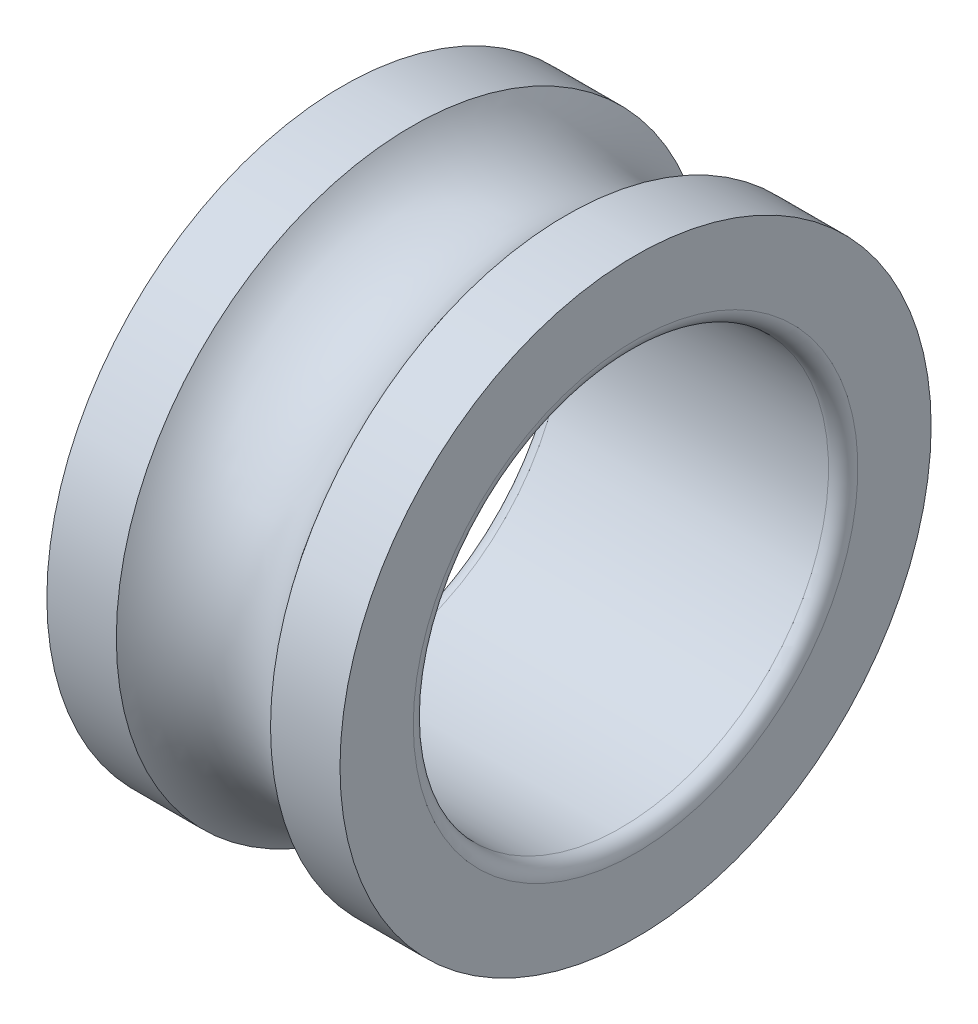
ISO-10303-21;
HEADER;
FILE_DESCRIPTION(('STEP AP214'),'2;1');
FILE_NAME('part.step','',(''),(''),'','','');
FILE_SCHEMA(('AUTOMOTIVE_DESIGN { 1 0 10303 214 1 1 1 1 }'));
ENDSEC;
DATA;
#1=APPLICATION_CONTEXT('core data for automotive mechanical design processes');
#2=APPLICATION_PROTOCOL_DEFINITION('international standard','automotive_design',2000,#1);
#3=PRODUCT_CONTEXT('',#1,'mechanical');
#4=PRODUCT('Part','Part','',(#3));
#5=PRODUCT_RELATED_PRODUCT_CATEGORY('part','',(#4));
#6=PRODUCT_DEFINITION_FORMATION('','',#4);
#7=PRODUCT_DEFINITION_CONTEXT('part definition',#1,'design');
#8=PRODUCT_DEFINITION('design','',#6,#7);
#9=PRODUCT_DEFINITION_SHAPE('','',#8);
#10=(LENGTH_UNIT() NAMED_UNIT(*) SI_UNIT(.MILLI.,.METRE.));
#11=(NAMED_UNIT(*) PLANE_ANGLE_UNIT() SI_UNIT($,.RADIAN.));
#12=(NAMED_UNIT(*) SI_UNIT($,.STERADIAN.) SOLID_ANGLE_UNIT());
#13=UNCERTAINTY_MEASURE_WITH_UNIT(LENGTH_MEASURE(1.E-05),#10,'distance_accuracy_value','');
#14=(GEOMETRIC_REPRESENTATION_CONTEXT(3) GLOBAL_UNCERTAINTY_ASSIGNED_CONTEXT((#13)) GLOBAL_UNIT_ASSIGNED_CONTEXT((#10,
#11,#12)) REPRESENTATION_CONTEXT('',''));
#15=CARTESIAN_POINT('',(0.,0.,0.));
#16=DIRECTION('',(0.,0.,1.));
#17=DIRECTION('',(1.,0.,0.));
#18=AXIS2_PLACEMENT_3D('',#15,#16,#17);
#19=CARTESIAN_POINT('',(0.,0.,0.));
#20=DIRECTION('',(-1.,0.,0.));
#21=DIRECTION('',(0.,0.,1.));
#22=AXIS2_PLACEMENT_3D('',#19,#20,#21);
#23=CYLINDRICAL_SURFACE('',#22,12.1);
#24=CARTESIAN_POINT('',(0.,0.,0.));
#25=DIRECTION('',(-1.,0.,0.));
#26=DIRECTION('',(0.,0.,1.));
#27=AXIS2_PLACEMENT_3D('',#24,#25,#26);
#28=CIRCLE('',#27,12.1);
#29=CARTESIAN_POINT('',(0.,0.,12.1));
#30=VERTEX_POINT('',#29);
#31=EDGE_CURVE('E10',#30,#30,#28,.T.);
#32=ORIENTED_EDGE('',*,*,#31,.F.);
#33=EDGE_LOOP('',(#32));
#34=FACE_BOUND('',#33,.T.);
#35=CARTESIAN_POINT('',(2.84344817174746,0.,0.));
#36=DIRECTION('',(-1.,0.,0.));
#37=DIRECTION('',(0.,0.,1.));
#38=AXIS2_PLACEMENT_3D('',#35,#36,#37);
#39=CIRCLE('',#38,12.1);
#40=CARTESIAN_POINT('',(2.84344817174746,0.,12.1));
#41=VERTEX_POINT('',#40);
#42=EDGE_CURVE('E42',#41,#41,#39,.T.);
#43=ORIENTED_EDGE('',*,*,#42,.T.);
#44=EDGE_LOOP('',(#43));
#45=FACE_BOUND('',#44,.T.);
#46=ADVANCED_FACE('F14',(#34,#45),#23,.T.);
#47=CARTESIAN_POINT('',(0.,12.1,0.));
#48=DIRECTION('',(1.,0.,0.));
#49=DIRECTION('',(0.,0.,-1.));
#50=AXIS2_PLACEMENT_3D('',#47,#48,#49);
#51=PLANE('',#50);
#52=CARTESIAN_POINT('',(0.,0.,0.));
#53=DIRECTION('',(-1.,0.,0.));
#54=DIRECTION('',(0.,0.,1.));
#55=AXIS2_PLACEMENT_3D('',#52,#53,#54);
#56=CIRCLE('',#55,9.1);
#57=CARTESIAN_POINT('',(0.,0.,9.1));
#58=VERTEX_POINT('',#57);
#59=EDGE_CURVE('E20',#58,#58,#56,.T.);
#60=ORIENTED_EDGE('',*,*,#59,.F.);
#61=EDGE_LOOP('',(#60));
#62=FACE_BOUND('',#61,.T.);
#63=ORIENTED_EDGE('',*,*,#31,.T.);
#64=EDGE_LOOP('',(#63));
#65=FACE_BOUND('',#64,.T.);
#66=ADVANCED_FACE('F60',(#62,#65),#51,.F.);
#67=CARTESIAN_POINT('',(0.6,0.,0.));
#68=DIRECTION('',(-1.,0.,0.));
#69=DIRECTION('',(0.,0.,1.));
#70=AXIS2_PLACEMENT_3D('',#67,#68,#69);
#71=TOROIDAL_SURFACE('',#70,9.1,0.6);
#72=CARTESIAN_POINT('',(0.6,0.,0.));
#73=DIRECTION('',(-1.,0.,0.));
#74=DIRECTION('',(0.,0.,1.));
#75=AXIS2_PLACEMENT_3D('',#72,#73,#74);
#76=CIRCLE('',#75,8.5);
#77=CARTESIAN_POINT('',(0.6,0.,8.5));
#78=VERTEX_POINT('',#77);
#79=EDGE_CURVE('E24',#78,#78,#76,.T.);
#80=ORIENTED_EDGE('',*,*,#79,.F.);
#81=EDGE_LOOP('',(#80));
#82=FACE_BOUND('',#81,.T.);
#83=ORIENTED_EDGE('',*,*,#59,.T.);
#84=EDGE_LOOP('',(#83));
#85=FACE_BOUND('',#84,.T.);
#86=ADVANCED_FACE('F65',(#82,#85),#71,.T.);
#87=CARTESIAN_POINT('',(0.,0.,0.));
#88=DIRECTION('',(-1.,0.,0.));
#89=DIRECTION('',(0.,0.,1.));
#90=AXIS2_PLACEMENT_3D('',#87,#88,#89);
#91=CYLINDRICAL_SURFACE('',#90,8.5);
#92=CARTESIAN_POINT('',(11.4,0.,0.));
#93=DIRECTION('',(-1.,0.,0.));
#94=DIRECTION('',(0.,0.,1.));
#95=AXIS2_PLACEMENT_3D('',#92,#93,#94);
#96=CIRCLE('',#95,8.5);
#97=CARTESIAN_POINT('',(11.4,0.,8.5));
#98=VERTEX_POINT('',#97);
#99=EDGE_CURVE('E28',#98,#98,#96,.T.);
#100=ORIENTED_EDGE('',*,*,#99,.F.);
#101=EDGE_LOOP('',(#100));
#102=FACE_BOUND('',#101,.T.);
#103=ORIENTED_EDGE('',*,*,#79,.T.);
#104=EDGE_LOOP('',(#103));
#105=FACE_BOUND('',#104,.T.);
#106=ADVANCED_FACE('F70',(#102,#105),#91,.F.);
#107=CARTESIAN_POINT('',(11.4,0.,0.));
#108=DIRECTION('',(-1.,0.,0.));
#109=DIRECTION('',(0.,0.,1.));
#110=AXIS2_PLACEMENT_3D('',#107,#108,#109);
#111=TOROIDAL_SURFACE('',#110,9.1,0.6);
#112=CARTESIAN_POINT('',(12.,0.,0.));
#113=DIRECTION('',(-1.,0.,0.));
#114=DIRECTION('',(0.,0.,1.));
#115=AXIS2_PLACEMENT_3D('',#112,#113,#114);
#116=CIRCLE('',#115,9.1);
#117=CARTESIAN_POINT('',(12.,0.,9.1));
#118=VERTEX_POINT('',#117);
#119=EDGE_CURVE('E33',#118,#118,#116,.T.);
#120=ORIENTED_EDGE('',*,*,#119,.F.);
#121=EDGE_LOOP('',(#120));
#122=FACE_BOUND('',#121,.T.);
#123=ORIENTED_EDGE('',*,*,#99,.T.);
#124=EDGE_LOOP('',(#123));
#125=FACE_BOUND('',#124,.T.);
#126=ADVANCED_FACE('F76',(#122,#125),#111,.T.);
#127=CARTESIAN_POINT('',(12.,9.1,0.));
#128=DIRECTION('',(-1.,0.,0.));
#129=DIRECTION('',(0.,0.,1.));
#130=AXIS2_PLACEMENT_3D('',#127,#128,#129);
#131=PLANE('',#130);
#132=CARTESIAN_POINT('',(12.,0.,0.));
#133=DIRECTION('',(-1.,0.,0.));
#134=DIRECTION('',(0.,0.,1.));
#135=AXIS2_PLACEMENT_3D('',#132,#133,#134);
#136=CIRCLE('',#135,12.1);
#137=CARTESIAN_POINT('',(12.,0.,12.1));
#138=VERTEX_POINT('',#137);
#139=EDGE_CURVE('E36',#138,#138,#136,.T.);
#140=ORIENTED_EDGE('',*,*,#139,.F.);
#141=EDGE_LOOP('',(#140));
#142=FACE_BOUND('',#141,.T.);
#143=ORIENTED_EDGE('',*,*,#119,.T.);
#144=EDGE_LOOP('',(#143));
#145=FACE_BOUND('',#144,.T.);
#146=ADVANCED_FACE('F56',(#142,#145),#131,.F.);
#147=CARTESIAN_POINT('',(0.,0.,0.));
#148=DIRECTION('',(-1.,0.,0.));
#149=DIRECTION('',(0.,0.,1.));
#150=AXIS2_PLACEMENT_3D('',#147,#148,#149);
#151=CYLINDRICAL_SURFACE('',#150,12.1);
#152=CARTESIAN_POINT('',(9.15655182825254,0.,0.));
#153=DIRECTION('',(-1.,0.,0.));
#154=DIRECTION('',(0.,0.,1.));
#155=AXIS2_PLACEMENT_3D('',#152,#153,#154);
#156=CIRCLE('',#155,12.1);
#157=CARTESIAN_POINT('',(9.15655182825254,0.,12.1));
#158=VERTEX_POINT('',#157);
#159=EDGE_CURVE('E39',#158,#158,#156,.T.);
#160=ORIENTED_EDGE('',*,*,#159,.F.);
#161=EDGE_LOOP('',(#160));
#162=FACE_BOUND('',#161,.T.);
#163=ORIENTED_EDGE('',*,*,#139,.T.);
#164=EDGE_LOOP('',(#163));
#165=FACE_BOUND('',#164,.T.);
#166=ADVANCED_FACE('F49',(#162,#165),#151,.T.);
#167=CARTESIAN_POINT('',(6.,0.,0.));
#168=DIRECTION('',(-1.,0.,0.));
#169=DIRECTION('',(0.,0.,1.));
#170=AXIS2_PLACEMENT_3D('',#167,#168,#169);
#171=TOROIDAL_SURFACE('',#170,14.275,3.83333333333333);
#172=ORIENTED_EDGE('',*,*,#159,.T.);
#173=EDGE_LOOP('',(#172));
#174=FACE_BOUND('',#173,.T.);
#175=ORIENTED_EDGE('',*,*,#42,.F.);
#176=EDGE_LOOP('',(#175));
#177=FACE_BOUND('',#176,.T.);
#178=ADVANCED_FACE('F47',(#174,#177),#171,.F.);
#179=CLOSED_SHELL('',(#46,#66,#86,#106,#126,#146,#166,#178));
#180=MANIFOLD_SOLID_BREP('B1',#179);
#181=ADVANCED_BREP_SHAPE_REPRESENTATION('',(#18,#180),#14);
#182=SHAPE_DEFINITION_REPRESENTATION(#9,#181);
ENDSEC;
END-ISO-10303-21;
